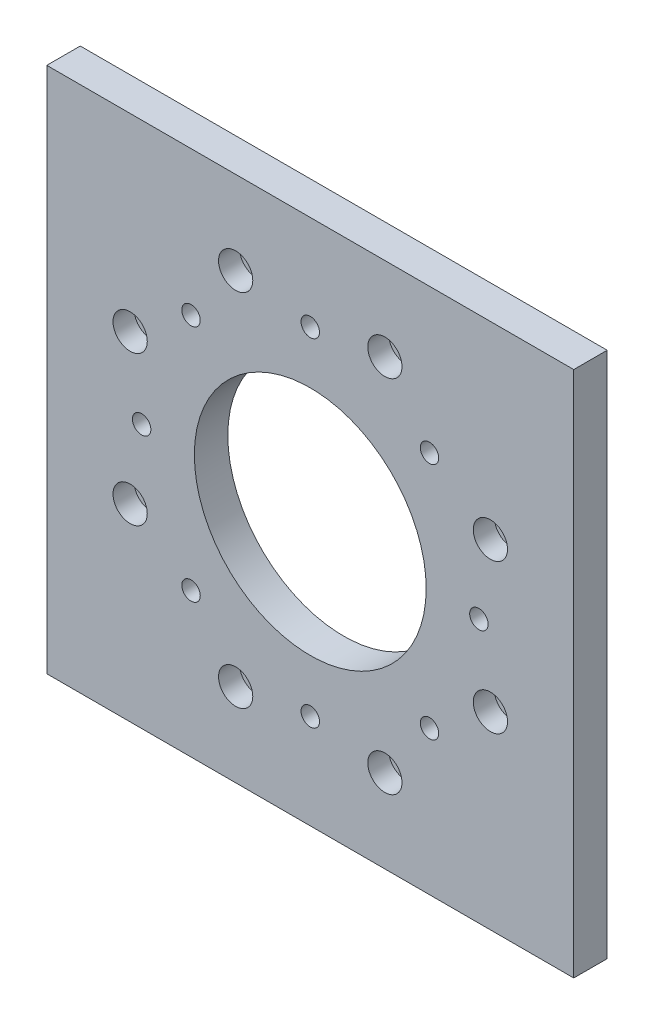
from build123d import *

# Parameters (mm, degrees)
SKETCH2_W                     = 100
SKETCH2_H                     = 100
PLACA_DEPTH                   = 6.35
SKETCH3_R                     = 1.75
BARRENOS_RODAMIENTO_DEPTH     = 71.995228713
SKETCH4_R                     = 22
BARRENOS_CENTRAL_MOTOR_DEPTH  = 71.995228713
SKETCH5_R                     = 1.5
BARRENOS_SUJECION_MOTOR_DEPTH = 71.995228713
SKETCH6_R                     = 3.25
CUT_EXTRUDE1_DEPTH            = 4


with BuildPart() as part:
    # Sketch2 → Placa (new body)
    with BuildSketch(Plane(origin=(0, 0, 0), x_dir=(0, 1, 0), z_dir=(0, 0, 1))):
        Rectangle(SKETCH2_W, SKETCH2_H)
    extrude(amount=PLACA_DEPTH)

    # Sketch3 → Barrenos_rodamiento (cut, through all)
    with BuildSketch(Plane.XY.offset(6.35)):
        with Locations((32, 0)):
            Circle(SKETCH3_R)
        with Locations((22.627416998, -22.627416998)):
            Circle(SKETCH3_R)
        with Locations((0, -32)):
            Circle(SKETCH3_R)
        with Locations((-22.627416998, -22.627416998)):
            Circle(SKETCH3_R)
        with Locations((-32, 0)):
            Circle(SKETCH3_R)
        with Locations((-22.627416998, 22.627416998)):
            Circle(SKETCH3_R)
        with Locations((0, 32)):
            Circle(SKETCH3_R)
        with Locations((22.627416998, 22.627416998)):
            Circle(SKETCH3_R)
    extrude(amount=-BARRENOS_RODAMIENTO_DEPTH, mode=Mode.SUBTRACT)

    # Sketch4 → Barrenos_central_motor (cut, through all)
    with BuildSketch(Plane.XY.offset(6.35)):
        Circle(SKETCH4_R)
    extrude(amount=-BARRENOS_CENTRAL_MOTOR_DEPTH, mode=Mode.SUBTRACT)

    # Sketch5 → Barrenos_sujecion_motor (cut, through all)
    with BuildSketch(Plane.XY.offset(6.35)):
        with Locations((34.183542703, 14.159286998)):
            Circle(SKETCH5_R)
        with Locations((34.183542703, -14.159286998)):
            Circle(SKETCH5_R)
        with Locations((14.159286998, -34.183542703)):
            Circle(SKETCH5_R)
        with Locations((-14.159286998, -34.183542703)):
            Circle(SKETCH5_R)
        with Locations((-34.183542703, -14.159286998)):
            Circle(SKETCH5_R)
        with Locations((-34.183542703, 14.159286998)):
            Circle(SKETCH5_R)
        with Locations((-14.159286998, 34.183542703)):
            Circle(SKETCH5_R)
        with Locations((14.159286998, 34.183542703)):
            Circle(SKETCH5_R)
    extrude(amount=-BARRENOS_SUJECION_MOTOR_DEPTH, mode=Mode.SUBTRACT)

    # Sketch6 → Cut-Extrude1 (cut)
    with BuildSketch(Plane(origin=(0, 0, 6.35), x_dir=(0, -1, 0), z_dir=(0, 0, 1))):
        with Locations(Location((-14.159286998, 34.183542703, 0), (0, 0, 90))):
            Circle(SKETCH6_R)
        with Locations(Location((14.159286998, 34.183542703, 0), (0, 0, 90))):
            Circle(SKETCH6_R)
        with Locations(Location((34.183542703, 14.159286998, 0), (0, 0, 90))):
            Circle(SKETCH6_R)
        with Locations(Location((34.183542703, -14.159286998, 0), (0, 0, 90))):
            Circle(SKETCH6_R)
        with Locations(Location((14.159286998, -34.183542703, 0), (0, 0, 90))):
            Circle(SKETCH6_R)
        with Locations(Location((-14.159286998, -34.183542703, 0), (0, 0, 90))):
            Circle(SKETCH6_R)
        with Locations(Location((-34.183542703, -14.159286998, 0), (0, 0, 90))):
            Circle(SKETCH6_R)
        with Locations(Location((-34.183542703, 14.159286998, 0), (0, 0, 90))):
            Circle(SKETCH6_R)
    extrude(amount=-CUT_EXTRUDE1_DEPTH, mode=Mode.SUBTRACT)


solid = part.part
